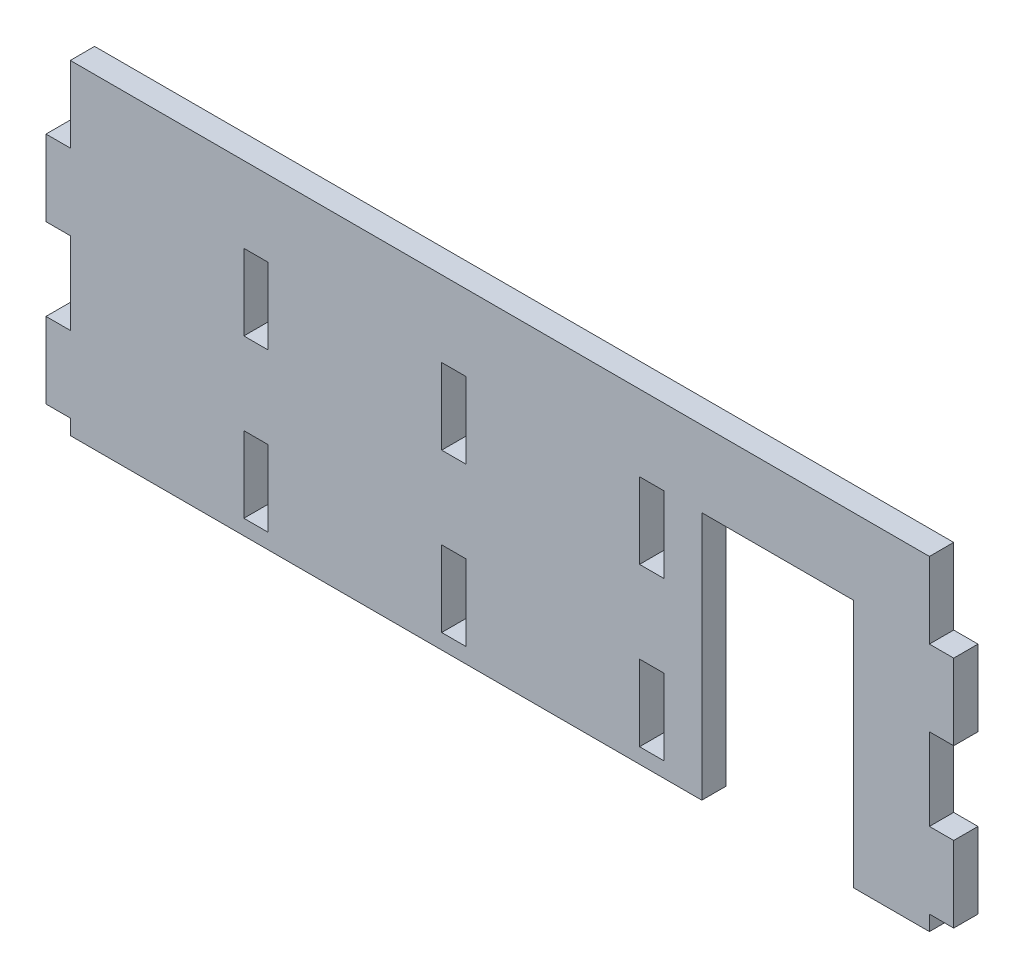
from build123d import *

# Parameters (mm, degrees)
SKETCH1_W           = 16
SKETCH1_H           = 50
BOSS_EXTRUDE1_DEPTH = 16


with BuildPart() as part:
    # Sketch1 → Boss-Extrude1 (new body)
    with BuildSketch(Plane.XY):
        Polygon((565.8, 254), (0, 254), (0, 204), (-16, 204), (-16, 154), (0, 154), (0, 100), (-16, 100), (-16, 50), (0, 50), (0, 40), (415.9, 40), (415.9, 204), (515.9, 204), (515.9, 40), (565.8, 40), (565.8, 50), (581.8, 50), (581.8, 100), (565.8, 100), (565.8, 154), (581.8, 154), (581.8, 204), (565.8, 204), align=None)
        with Locations((122.3, 75)):
            Rectangle(SKETCH1_W, SKETCH1_H, mode=Mode.SUBTRACT)
        with Locations((252.6, 75)):
            Rectangle(SKETCH1_W, SKETCH1_H, mode=Mode.SUBTRACT)
        with Locations((382.9, 75)):
            Rectangle(SKETCH1_W, SKETCH1_H, mode=Mode.SUBTRACT)
        with Locations((122.3, 179)):
            Rectangle(SKETCH1_W, SKETCH1_H, mode=Mode.SUBTRACT)
        with Locations((252.6, 179)):
            Rectangle(SKETCH1_W, SKETCH1_H, mode=Mode.SUBTRACT)
        with Locations((382.9, 179)):
            Rectangle(SKETCH1_W, SKETCH1_H, mode=Mode.SUBTRACT)
    extrude(amount=BOSS_EXTRUDE1_DEPTH)


solid = part.part
